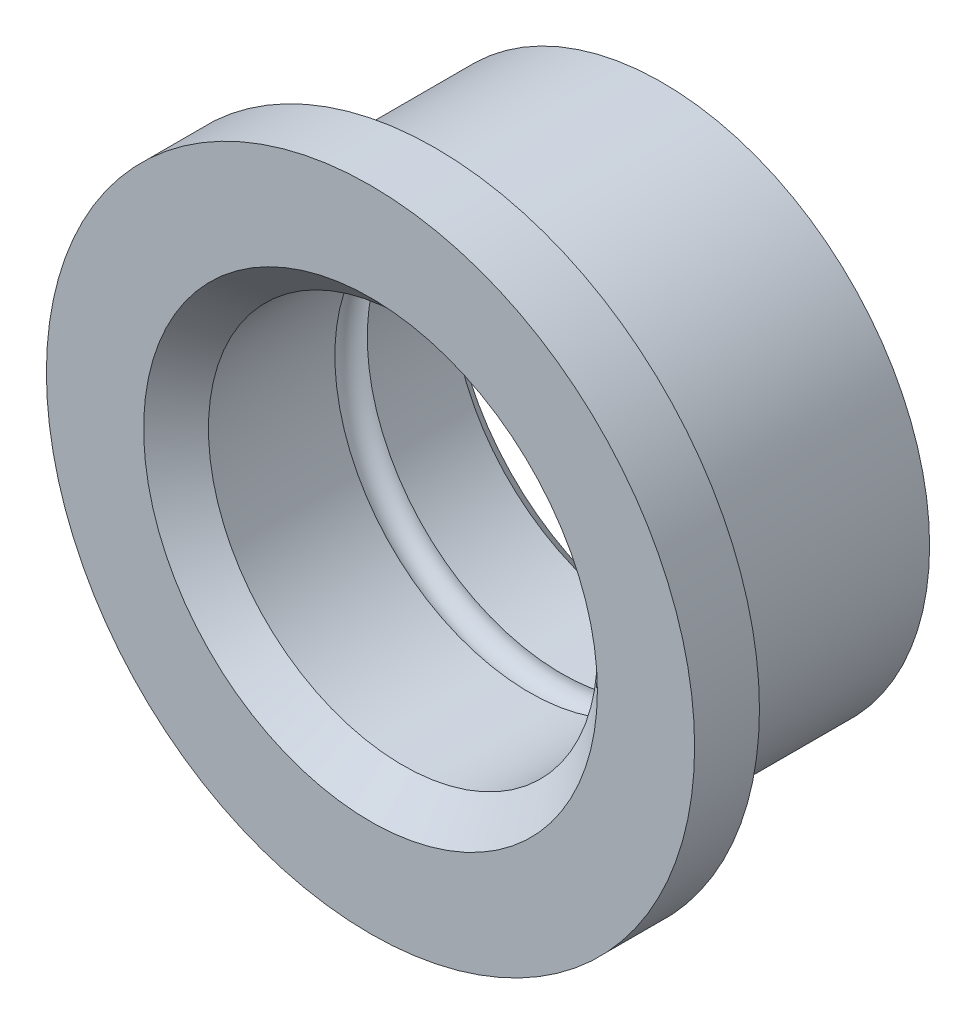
ISO-10303-21;
HEADER;
FILE_DESCRIPTION(('STEP AP214'),'2;1');
FILE_NAME('part.step','',(''),(''),'','','');
FILE_SCHEMA(('AUTOMOTIVE_DESIGN { 1 0 10303 214 1 1 1 1 }'));
ENDSEC;
DATA;
#1=APPLICATION_CONTEXT('core data for automotive mechanical design processes');
#2=APPLICATION_PROTOCOL_DEFINITION('international standard','automotive_design',2000,#1);
#3=PRODUCT_CONTEXT('',#1,'mechanical');
#4=PRODUCT('Part','Part','',(#3));
#5=PRODUCT_RELATED_PRODUCT_CATEGORY('part','',(#4));
#6=PRODUCT_DEFINITION_FORMATION('','',#4);
#7=PRODUCT_DEFINITION_CONTEXT('part definition',#1,'design');
#8=PRODUCT_DEFINITION('design','',#6,#7);
#9=PRODUCT_DEFINITION_SHAPE('','',#8);
#10=(LENGTH_UNIT() NAMED_UNIT(*) SI_UNIT(.MILLI.,.METRE.));
#11=(NAMED_UNIT(*) PLANE_ANGLE_UNIT() SI_UNIT($,.RADIAN.));
#12=(NAMED_UNIT(*) SI_UNIT($,.STERADIAN.) SOLID_ANGLE_UNIT());
#13=UNCERTAINTY_MEASURE_WITH_UNIT(LENGTH_MEASURE(1.E-05),#10,'distance_accuracy_value','');
#14=(GEOMETRIC_REPRESENTATION_CONTEXT(3) GLOBAL_UNCERTAINTY_ASSIGNED_CONTEXT((#13)) GLOBAL_UNIT_ASSIGNED_CONTEXT((#10,
#11,#12)) REPRESENTATION_CONTEXT('',''));
#15=CARTESIAN_POINT('',(0.,0.,0.));
#16=DIRECTION('',(0.,0.,1.));
#17=DIRECTION('',(1.,0.,0.));
#18=AXIS2_PLACEMENT_3D('',#15,#16,#17);
#19=CARTESIAN_POINT('',(0.,-31.75,-7.));
#20=DIRECTION('',(0.,0.,1.));
#21=DIRECTION('',(1.,0.,0.));
#22=AXIS2_PLACEMENT_3D('',#19,#20,#21);
#23=CYLINDRICAL_SURFACE('',#22,6.00000000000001);
#24=CARTESIAN_POINT('',(0.,-31.75,1.));
#25=DIRECTION('',(0.,0.,1.));
#26=DIRECTION('',(1.,0.,0.));
#27=AXIS2_PLACEMENT_3D('',#24,#25,#26);
#28=CIRCLE('',#27,6.00000000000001);
#29=CARTESIAN_POINT('',(6.,-31.75,1.));
#30=VERTEX_POINT('',#29);
#31=EDGE_CURVE('E37',#30,#30,#28,.T.);
#32=ORIENTED_EDGE('',*,*,#31,.T.);
#33=EDGE_LOOP('',(#32));
#34=FACE_BOUND('',#33,.T.);
#35=CARTESIAN_POINT('',(0.,-31.75,-2.9));
#36=DIRECTION('',(0.,0.,1.));
#37=DIRECTION('',(1.,0.,0.));
#38=AXIS2_PLACEMENT_3D('',#35,#36,#37);
#39=CIRCLE('',#38,6.);
#40=CARTESIAN_POINT('',(6.,-31.75,-2.9));
#41=VERTEX_POINT('',#40);
#42=EDGE_CURVE('E160',#41,#41,#39,.T.);
#43=ORIENTED_EDGE('',*,*,#42,.F.);
#44=EDGE_LOOP('',(#43));
#45=FACE_BOUND('',#44,.T.);
#46=ADVANCED_FACE('F29',(#34,#45),#23,.F.);
#47=CARTESIAN_POINT('',(0.,-31.75,-7.));
#48=DIRECTION('',(0.,0.,1.));
#49=DIRECTION('',(1.,0.,0.));
#50=AXIS2_PLACEMENT_3D('',#47,#48,#49);
#51=CYLINDRICAL_SURFACE('',#50,8.25000000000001);
#52=CARTESIAN_POINT('',(0.,-31.75,-7.));
#53=DIRECTION('',(0.,0.,1.));
#54=DIRECTION('',(1.,0.,0.));
#55=AXIS2_PLACEMENT_3D('',#52,#53,#54);
#56=CIRCLE('',#55,8.25000000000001);
#57=CARTESIAN_POINT('',(8.25,-31.75,-7.));
#58=VERTEX_POINT('',#57);
#59=EDGE_CURVE('E76',#58,#58,#56,.T.);
#60=ORIENTED_EDGE('',*,*,#59,.T.);
#61=EDGE_LOOP('',(#60));
#62=FACE_BOUND('',#61,.T.);
#63=CARTESIAN_POINT('',(0.,-31.75,0.));
#64=DIRECTION('',(0.,0.,1.));
#65=DIRECTION('',(1.,0.,0.));
#66=AXIS2_PLACEMENT_3D('',#63,#64,#65);
#67=CIRCLE('',#66,8.25000000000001);
#68=CARTESIAN_POINT('',(-8.00390529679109,-33.75,0.));
#69=VERTEX_POINT('',#68);
#70=CARTESIAN_POINT('',(-8.00390529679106,-29.75,0.));
#71=VERTEX_POINT('',#70);
#72=EDGE_CURVE('E69',#69,#71,#67,.T.);
#73=ORIENTED_EDGE('',*,*,#72,.F.);
#74=DIRECTION('',(0.,0.,1.));
#75=VECTOR('',#74,1.);
#76=CARTESIAN_POINT('',(-8.00390529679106,-33.75,-4.));
#77=LINE('',#76,#75);
#78=CARTESIAN_POINT('',(-8.00390529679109,-33.75,-4.));
#79=VERTEX_POINT('',#78);
#80=EDGE_CURVE('E44',#79,#69,#77,.T.);
#81=ORIENTED_EDGE('',*,*,#80,.F.);
#82=CARTESIAN_POINT('',(0.,-31.75,-4.));
#83=DIRECTION('',(0.,0.,1.));
#84=DIRECTION('',(-1.,0.,0.));
#85=AXIS2_PLACEMENT_3D('',#82,#83,#84);
#86=CIRCLE('',#85,8.24999999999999);
#87=CARTESIAN_POINT('',(-8.00390529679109,-29.75,-4.));
#88=VERTEX_POINT('',#87);
#89=EDGE_CURVE('E49',#88,#79,#86,.T.);
#90=ORIENTED_EDGE('',*,*,#89,.F.);
#91=DIRECTION('',(0.,0.,1.));
#92=VECTOR('',#91,1.);
#93=CARTESIAN_POINT('',(-8.00390529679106,-29.75,-4.));
#94=LINE('',#93,#92);
#95=EDGE_CURVE('E80',#88,#71,#94,.T.);
#96=ORIENTED_EDGE('',*,*,#95,.T.);
#97=EDGE_LOOP('',(#73,#81,#90,#96));
#98=FACE_BOUND('',#97,.T.);
#99=ADVANCED_FACE('F31',(#62,#98),#51,.T.);
#100=CARTESIAN_POINT('',(0.,-31.75,0.));
#101=DIRECTION('',(0.,0.,1.));
#102=DIRECTION('',(1.,0.,0.));
#103=AXIS2_PLACEMENT_3D('',#100,#101,#102);
#104=PLANE('',#103);
#105=CARTESIAN_POINT('',(0.,-31.75,0.));
#106=DIRECTION('',(0.,0.,1.));
#107=DIRECTION('',(1.,0.,0.));
#108=AXIS2_PLACEMENT_3D('',#105,#106,#107);
#109=CIRCLE('',#108,10.);
#110=CARTESIAN_POINT('',(10.,-31.75,0.));
#111=VERTEX_POINT('',#110);
#112=EDGE_CURVE('E105',#111,#111,#109,.T.);
#113=ORIENTED_EDGE('',*,*,#112,.F.);
#114=EDGE_LOOP('',(#113));
#115=FACE_BOUND('',#114,.T.);
#116=DIRECTION('',(-1.,0.,0.));
#117=VECTOR('',#116,1.);
#118=CARTESIAN_POINT('',(-8.00390529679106,-33.75,0.));
#119=LINE('',#118,#117);
#120=CARTESIAN_POINT('',(-9.54266734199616,-33.75,0.));
#121=VERTEX_POINT('',#120);
#122=EDGE_CURVE('E75',#69,#121,#119,.T.);
#123=ORIENTED_EDGE('',*,*,#122,.F.);
#124=ORIENTED_EDGE('',*,*,#72,.T.);
#125=DIRECTION('',(1.,0.,0.));
#126=VECTOR('',#125,1.);
#127=CARTESIAN_POINT('',(-8.00390529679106,-29.75,0.));
#128=LINE('',#127,#126);
#129=CARTESIAN_POINT('',(-9.54266734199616,-29.75,0.));
#130=VERTEX_POINT('',#129);
#131=EDGE_CURVE('E72',#130,#71,#128,.T.);
#132=ORIENTED_EDGE('',*,*,#131,.F.);
#133=CARTESIAN_POINT('',(0.,-31.75,0.));
#134=DIRECTION('',(0.,0.,-1.));
#135=DIRECTION('',(-1.,0.,0.));
#136=AXIS2_PLACEMENT_3D('',#133,#134,#135);
#137=CIRCLE('',#136,9.74999999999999);
#138=EDGE_CURVE('E89',#121,#130,#137,.T.);
#139=ORIENTED_EDGE('',*,*,#138,.F.);
#140=EDGE_LOOP('',(#123,#124,#132,#139));
#141=FACE_BOUND('',#140,.T.);
#142=ADVANCED_FACE('F70',(#115,#141),#104,.F.);
#143=CARTESIAN_POINT('',(0.,-31.75,-7.));
#144=DIRECTION('',(0.,0.,1.));
#145=DIRECTION('',(1.,0.,0.));
#146=AXIS2_PLACEMENT_3D('',#143,#144,#145);
#147=PLANE('',#146);
#148=CARTESIAN_POINT('',(0.,-31.75,-7.));
#149=DIRECTION('',(0.,0.,1.));
#150=DIRECTION('',(1.,0.,0.));
#151=AXIS2_PLACEMENT_3D('',#148,#149,#150);
#152=CIRCLE('',#151,6.50000000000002);
#153=CARTESIAN_POINT('',(6.50000000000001,-31.75,-7.));
#154=VERTEX_POINT('',#153);
#155=EDGE_CURVE('E112',#154,#154,#152,.T.);
#156=ORIENTED_EDGE('',*,*,#155,.T.);
#157=EDGE_LOOP('',(#156));
#158=FACE_BOUND('',#157,.T.);
#159=ORIENTED_EDGE('',*,*,#59,.F.);
#160=EDGE_LOOP('',(#159));
#161=FACE_BOUND('',#160,.T.);
#162=ADVANCED_FACE('F144',(#158,#161),#147,.F.);
#163=CARTESIAN_POINT('',(0.,-31.75,-6.5));
#164=DIRECTION('',(0.,0.,1.));
#165=DIRECTION('',(1.,0.,0.));
#166=AXIS2_PLACEMENT_3D('',#163,#164,#165);
#167=CIRCLE('',#166,6.00000000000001);
#168=CARTESIAN_POINT('',(6.,-31.75,-6.5));
#169=VERTEX_POINT('',#168);
#170=EDGE_CURVE('E115',#169,#169,#167,.F.);
#171=ORIENTED_EDGE('',*,*,#170,.T.);
#172=EDGE_LOOP('',(#171));
#173=FACE_BOUND('',#172,.T.);
#174=CARTESIAN_POINT('',(0.,-31.75,-3.9));
#175=DIRECTION('',(0.,0.,1.));
#176=DIRECTION('',(1.,0.,0.));
#177=AXIS2_PLACEMENT_3D('',#174,#175,#176);
#178=CIRCLE('',#177,6.);
#179=CARTESIAN_POINT('',(6.,-31.75,-3.9));
#180=VERTEX_POINT('',#179);
#181=EDGE_CURVE('E158',#180,#180,#178,.T.);
#182=ORIENTED_EDGE('',*,*,#181,.T.);
#183=EDGE_LOOP('',(#182));
#184=FACE_BOUND('',#183,.T.);
#185=ADVANCED_FACE('F136',(#173,#184),#23,.F.);
#186=CARTESIAN_POINT('',(0.,-31.75,2.));
#187=DIRECTION('',(0.,0.,1.));
#188=DIRECTION('',(1.,0.,0.));
#189=AXIS2_PLACEMENT_3D('',#186,#187,#188);
#190=PLANE('',#189);
#191=CARTESIAN_POINT('',(0.,-31.75,2.));
#192=DIRECTION('',(0.,0.,1.));
#193=DIRECTION('',(1.,0.,0.));
#194=AXIS2_PLACEMENT_3D('',#191,#192,#193);
#195=CIRCLE('',#194,7.00000000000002);
#196=CARTESIAN_POINT('',(7.,-31.75,2.));
#197=VERTEX_POINT('',#196);
#198=EDGE_CURVE('E11',#197,#197,#195,.F.);
#199=ORIENTED_EDGE('',*,*,#198,.T.);
#200=EDGE_LOOP('',(#199));
#201=FACE_BOUND('',#200,.T.);
#202=CARTESIAN_POINT('',(0.,-31.75,2.));
#203=DIRECTION('',(0.,0.,1.));
#204=DIRECTION('',(1.,0.,0.));
#205=AXIS2_PLACEMENT_3D('',#202,#203,#204);
#206=CIRCLE('',#205,10.);
#207=CARTESIAN_POINT('',(10.,-31.75,2.));
#208=VERTEX_POINT('',#207);
#209=EDGE_CURVE('E77',#208,#208,#206,.T.);
#210=ORIENTED_EDGE('',*,*,#209,.T.);
#211=EDGE_LOOP('',(#210));
#212=FACE_BOUND('',#211,.T.);
#213=ADVANCED_FACE('F143',(#201,#212),#190,.T.);
#214=CARTESIAN_POINT('',(0.,-31.75,2.));
#215=DIRECTION('',(0.,0.,-1.));
#216=DIRECTION('',(-1.,0.,0.));
#217=AXIS2_PLACEMENT_3D('',#214,#215,#216);
#218=CYLINDRICAL_SURFACE('',#217,10.);
#219=ORIENTED_EDGE('',*,*,#209,.F.);
#220=EDGE_LOOP('',(#219));
#221=FACE_BOUND('',#220,.T.);
#222=ORIENTED_EDGE('',*,*,#112,.T.);
#223=EDGE_LOOP('',(#222));
#224=FACE_BOUND('',#223,.T.);
#225=ADVANCED_FACE('F150',(#221,#224),#218,.T.);
#226=CARTESIAN_POINT('',(-8.00390529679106,-33.75,-4.));
#227=DIRECTION('',(0.,1.,0.));
#228=DIRECTION('',(0.,0.,1.));
#229=AXIS2_PLACEMENT_3D('',#226,#227,#228);
#230=PLANE('',#229);
#231=ORIENTED_EDGE('',*,*,#122,.T.);
#232=DIRECTION('',(0.,0.,1.));
#233=VECTOR('',#232,1.);
#234=CARTESIAN_POINT('',(-9.54266734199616,-33.75,-4.));
#235=LINE('',#234,#233);
#236=CARTESIAN_POINT('',(-9.54266734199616,-33.75,-4.));
#237=VERTEX_POINT('',#236);
#238=EDGE_CURVE('E101',#237,#121,#235,.T.);
#239=ORIENTED_EDGE('',*,*,#238,.F.);
#240=DIRECTION('',(-1.,0.,0.));
#241=VECTOR('',#240,1.);
#242=CARTESIAN_POINT('',(-8.00390529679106,-33.75,-4.));
#243=LINE('',#242,#241);
#244=EDGE_CURVE('E91',#79,#237,#243,.T.);
#245=ORIENTED_EDGE('',*,*,#244,.F.);
#246=ORIENTED_EDGE('',*,*,#80,.T.);
#247=EDGE_LOOP('',(#231,#239,#245,#246));
#248=FACE_BOUND('',#247,.T.);
#249=ADVANCED_FACE('F180',(#248),#230,.F.);
#250=CARTESIAN_POINT('',(0.,-31.75,-4.));
#251=DIRECTION('',(0.,0.,1.));
#252=DIRECTION('',(1.,0.,0.));
#253=AXIS2_PLACEMENT_3D('',#250,#251,#252);
#254=CYLINDRICAL_SURFACE('',#253,9.74999999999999);
#255=ORIENTED_EDGE('',*,*,#138,.T.);
#256=DIRECTION('',(0.,0.,1.));
#257=VECTOR('',#256,1.);
#258=CARTESIAN_POINT('',(-9.54266734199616,-29.75,-4.));
#259=LINE('',#258,#257);
#260=CARTESIAN_POINT('',(-9.54266734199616,-29.75,-4.));
#261=VERTEX_POINT('',#260);
#262=EDGE_CURVE('E83',#261,#130,#259,.T.);
#263=ORIENTED_EDGE('',*,*,#262,.F.);
#264=CARTESIAN_POINT('',(0.,-31.75,-4.));
#265=DIRECTION('',(0.,0.,-1.));
#266=DIRECTION('',(-1.,0.,0.));
#267=AXIS2_PLACEMENT_3D('',#264,#265,#266);
#268=CIRCLE('',#267,9.74999999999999);
#269=EDGE_CURVE('E97',#237,#261,#268,.T.);
#270=ORIENTED_EDGE('',*,*,#269,.F.);
#271=ORIENTED_EDGE('',*,*,#238,.T.);
#272=EDGE_LOOP('',(#255,#263,#270,#271));
#273=FACE_BOUND('',#272,.T.);
#274=ADVANCED_FACE('F177',(#273),#254,.T.);
#275=CARTESIAN_POINT('',(-8.00390529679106,-29.75,-4.));
#276=DIRECTION('',(0.,-1.,0.));
#277=DIRECTION('',(0.,0.,-1.));
#278=AXIS2_PLACEMENT_3D('',#275,#276,#277);
#279=PLANE('',#278);
#280=ORIENTED_EDGE('',*,*,#131,.T.);
#281=ORIENTED_EDGE('',*,*,#95,.F.);
#282=DIRECTION('',(1.,0.,0.));
#283=VECTOR('',#282,1.);
#284=CARTESIAN_POINT('',(-8.00390529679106,-29.75,-4.));
#285=LINE('',#284,#283);
#286=EDGE_CURVE('E84',#261,#88,#285,.T.);
#287=ORIENTED_EDGE('',*,*,#286,.F.);
#288=ORIENTED_EDGE('',*,*,#262,.T.);
#289=EDGE_LOOP('',(#280,#281,#287,#288));
#290=FACE_BOUND('',#289,.T.);
#291=ADVANCED_FACE('F87',(#290),#279,.F.);
#292=CARTESIAN_POINT('',(0.,-31.75,-4.));
#293=DIRECTION('',(0.,0.,-1.));
#294=DIRECTION('',(-1.,0.,0.));
#295=AXIS2_PLACEMENT_3D('',#292,#293,#294);
#296=PLANE('',#295);
#297=ORIENTED_EDGE('',*,*,#89,.T.);
#298=ORIENTED_EDGE('',*,*,#244,.T.);
#299=ORIENTED_EDGE('',*,*,#269,.T.);
#300=ORIENTED_EDGE('',*,*,#286,.T.);
#301=EDGE_LOOP('',(#297,#298,#299,#300));
#302=FACE_BOUND('',#301,.T.);
#303=ADVANCED_FACE('F167',(#302),#296,.T.);
#304=CARTESIAN_POINT('',(0.,-31.75,-3.4));
#305=DIRECTION('',(0.,0.,1.));
#306=DIRECTION('',(1.,0.,0.));
#307=AXIS2_PLACEMENT_3D('',#304,#305,#306);
#308=TOROIDAL_SURFACE('',#307,6.,0.5);
#309=ORIENTED_EDGE('',*,*,#181,.F.);
#310=EDGE_LOOP('',(#309));
#311=FACE_BOUND('',#310,.T.);
#312=ORIENTED_EDGE('',*,*,#42,.T.);
#313=EDGE_LOOP('',(#312));
#314=FACE_BOUND('',#313,.T.);
#315=ADVANCED_FACE('F130',(#311,#314),#308,.F.);
#316=CARTESIAN_POINT('',(0.,-31.75,-7.));
#317=DIRECTION('',(0.,0.,-1.));
#318=DIRECTION('',(-1.,0.,0.));
#319=AXIS2_PLACEMENT_3D('',#316,#317,#318);
#320=CONICAL_SURFACE('',#319,6.50000000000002,0.785398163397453);
#321=ORIENTED_EDGE('',*,*,#170,.F.);
#322=EDGE_LOOP('',(#321));
#323=FACE_BOUND('',#322,.T.);
#324=ORIENTED_EDGE('',*,*,#155,.F.);
#325=EDGE_LOOP('',(#324));
#326=FACE_BOUND('',#325,.T.);
#327=ADVANCED_FACE('F124',(#323,#326),#320,.F.);
#328=CARTESIAN_POINT('',(0.,-31.75,1.));
#329=DIRECTION('',(0.,0.,1.));
#330=DIRECTION('',(1.,0.,0.));
#331=AXIS2_PLACEMENT_3D('',#328,#329,#330);
#332=CONICAL_SURFACE('',#331,6.00000000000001,0.785398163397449);
#333=ORIENTED_EDGE('',*,*,#198,.F.);
#334=EDGE_LOOP('',(#333));
#335=FACE_BOUND('',#334,.T.);
#336=ORIENTED_EDGE('',*,*,#31,.F.);
#337=EDGE_LOOP('',(#336));
#338=FACE_BOUND('',#337,.T.);
#339=ADVANCED_FACE('F122',(#335,#338),#332,.F.);
#340=CLOSED_SHELL('',(#46,#99,#142,#162,#185,#213,#225,#249,#274,#291,#303,#315,#327,#339));
#341=MANIFOLD_SOLID_BREP('B2',#340);
#342=ADVANCED_BREP_SHAPE_REPRESENTATION('',(#18,#341),#14);
#343=SHAPE_DEFINITION_REPRESENTATION(#9,#342);
ENDSEC;
END-ISO-10303-21;
